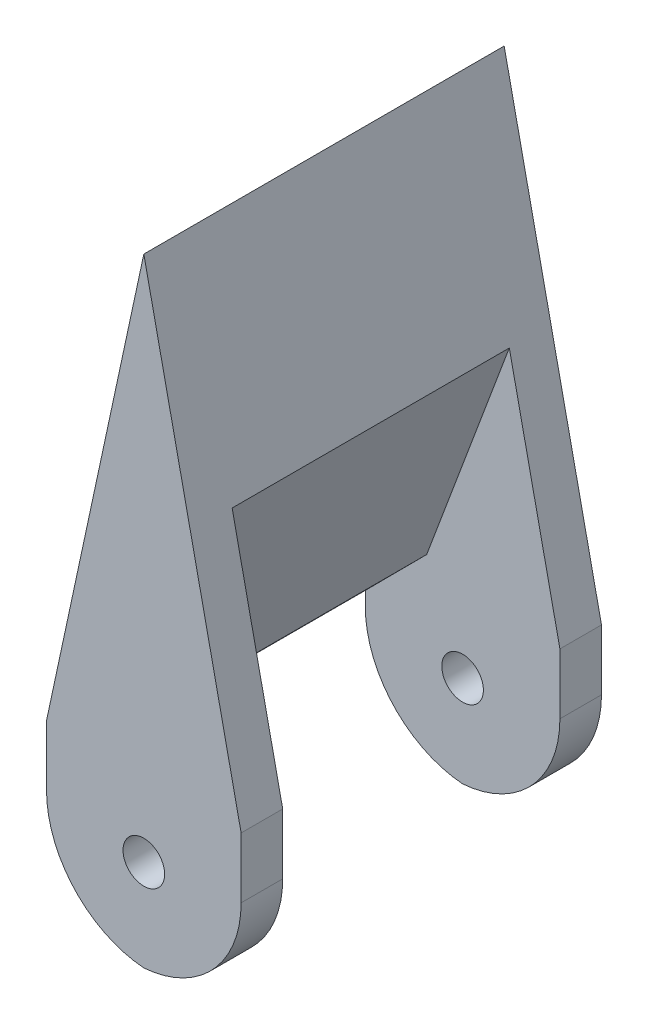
ISO-10303-21;
HEADER;
FILE_DESCRIPTION(('STEP AP214'),'2;1');
FILE_NAME('part.step','',(''),(''),'','','');
FILE_SCHEMA(('AUTOMOTIVE_DESIGN { 1 0 10303 214 1 1 1 1 }'));
ENDSEC;
DATA;
#1=APPLICATION_CONTEXT('core data for automotive mechanical design processes');
#2=APPLICATION_PROTOCOL_DEFINITION('international standard','automotive_design',2000,#1);
#3=PRODUCT_CONTEXT('',#1,'mechanical');
#4=PRODUCT('Part','Part','',(#3));
#5=PRODUCT_RELATED_PRODUCT_CATEGORY('part','',(#4));
#6=PRODUCT_DEFINITION_FORMATION('','',#4);
#7=PRODUCT_DEFINITION_CONTEXT('part definition',#1,'design');
#8=PRODUCT_DEFINITION('design','',#6,#7);
#9=PRODUCT_DEFINITION_SHAPE('','',#8);
#10=(LENGTH_UNIT() NAMED_UNIT(*) SI_UNIT(.MILLI.,.METRE.));
#11=(NAMED_UNIT(*) PLANE_ANGLE_UNIT() SI_UNIT($,.RADIAN.));
#12=(NAMED_UNIT(*) SI_UNIT($,.STERADIAN.) SOLID_ANGLE_UNIT());
#13=UNCERTAINTY_MEASURE_WITH_UNIT(LENGTH_MEASURE(1.E-05),#10,'distance_accuracy_value','');
#14=(GEOMETRIC_REPRESENTATION_CONTEXT(3) GLOBAL_UNCERTAINTY_ASSIGNED_CONTEXT((#13)) GLOBAL_UNIT_ASSIGNED_CONTEXT((#10,
#11,#12)) REPRESENTATION_CONTEXT('',''));
#15=CARTESIAN_POINT('',(0.,0.,0.));
#16=DIRECTION('',(0.,0.,1.));
#17=DIRECTION('',(1.,0.,0.));
#18=AXIS2_PLACEMENT_3D('',#15,#16,#17);
#19=CARTESIAN_POINT('',(-16.1838199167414,-7.6281283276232,6.5));
#20=DIRECTION('',(-1.,0.,0.));
#21=DIRECTION('',(0.,0.,1.));
#22=AXIS2_PLACEMENT_3D('',#19,#20,#21);
#23=PLANE('',#22);
#24=DIRECTION('',(0.,-1.,0.));
#25=VECTOR('',#24,1.);
#26=CARTESIAN_POINT('',(-16.1838199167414,-7.6281283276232,5.));
#27=LINE('',#26,#25);
#28=CARTESIAN_POINT('',(-16.1838199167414,-1.6441424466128,5.));
#29=VERTEX_POINT('',#28);
#30=CARTESIAN_POINT('',(-16.1838199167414,-3.8281283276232,5.));
#31=VERTEX_POINT('',#30);
#32=EDGE_CURVE('E51',#29,#31,#27,.T.);
#33=ORIENTED_EDGE('',*,*,#32,.F.);
#34=DIRECTION('',(0.,0.,-1.));
#35=VECTOR('',#34,1.);
#36=CARTESIAN_POINT('',(-16.1838199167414,-1.6441424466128,6.5));
#37=LINE('',#36,#35);
#38=CARTESIAN_POINT('',(-16.1838199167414,-1.6441424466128,6.5));
#39=VERTEX_POINT('',#38);
#40=EDGE_CURVE('E214',#39,#29,#37,.T.);
#41=ORIENTED_EDGE('',*,*,#40,.F.);
#42=DIRECTION('',(0.,1.,0.));
#43=VECTOR('',#42,1.);
#44=CARTESIAN_POINT('',(-16.1838199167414,-7.6281283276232,6.5));
#45=LINE('',#44,#43);
#46=CARTESIAN_POINT('',(-16.1838199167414,-3.8281283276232,6.5));
#47=VERTEX_POINT('',#46);
#48=EDGE_CURVE('E192',#47,#39,#45,.T.);
#49=ORIENTED_EDGE('',*,*,#48,.F.);
#50=DIRECTION('',(0.,0.,-1.));
#51=VECTOR('',#50,1.);
#52=CARTESIAN_POINT('',(-16.1838199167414,-3.8281283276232,6.5));
#53=LINE('',#52,#51);
#54=EDGE_CURVE('E218',#47,#31,#53,.T.);
#55=ORIENTED_EDGE('',*,*,#54,.T.);
#56=EDGE_LOOP('',(#33,#41,#49,#55));
#57=FACE_BOUND('',#56,.T.);
#58=ADVANCED_FACE('F36',(#57),#23,.F.);
#59=CARTESIAN_POINT('',(-19.694185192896,-4.3136274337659,6.5));
#60=DIRECTION('',(0.,0.,-1.));
#61=DIRECTION('',(-1.,0.,0.));
#62=AXIS2_PLACEMENT_3D('',#59,#60,#61);
#63=CYLINDRICAL_SURFACE('',#62,0.750000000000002);
#64=CARTESIAN_POINT('',(-19.694185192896,-4.3136274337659,6.5));
#65=DIRECTION('',(0.,0.,1.));
#66=DIRECTION('',(1.,0.,0.));
#67=AXIS2_PLACEMENT_3D('',#64,#65,#66);
#68=CIRCLE('',#67,0.750000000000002);
#69=CARTESIAN_POINT('',(-20.444185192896,-4.3136274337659,6.5));
#70=VERTEX_POINT('',#69);
#71=EDGE_CURVE('E182',#70,#70,#68,.T.);
#72=CARTESIAN_POINT('',(-19.694185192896,-4.3136274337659,5.));
#73=DIRECTION('',(0.,0.,-1.));
#74=DIRECTION('',(-1.,0.,0.));
#75=AXIS2_PLACEMENT_3D('',#72,#73,#74);
#76=CIRCLE('',#75,0.750000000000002);
#77=CARTESIAN_POINT('',(-20.444185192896,-4.3136274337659,5.));
#78=VERTEX_POINT('',#77);
#79=EDGE_CURVE('E164',#78,#78,#76,.T.);
#80=CARTESIAN_POINT('',(-20.444185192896,-4.3136274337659,6.5));
#81=CARTESIAN_POINT('',(-20.444185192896,-4.3136274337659,6.484375));
#82=CARTESIAN_POINT('',(-20.444185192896,-4.3136274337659,6.46875));
#83=CARTESIAN_POINT('',(-20.444185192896,-4.3136274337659,6.4375));
#84=CARTESIAN_POINT('',(-20.444185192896,-4.3136274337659,6.421875));
#85=CARTESIAN_POINT('',(-20.444185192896,-4.3136274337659,6.390625));
#86=CARTESIAN_POINT('',(-20.444185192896,-4.3136274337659,6.375));
#87=CARTESIAN_POINT('',(-20.444185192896,-4.3136274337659,6.34375));
#88=CARTESIAN_POINT('',(-20.444185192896,-4.3136274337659,6.328125));
#89=CARTESIAN_POINT('',(-20.444185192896,-4.3136274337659,6.296875));
#90=CARTESIAN_POINT('',(-20.444185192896,-4.3136274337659,6.28125));
#91=CARTESIAN_POINT('',(-20.444185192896,-4.3136274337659,6.25));
#92=CARTESIAN_POINT('',(-20.444185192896,-4.3136274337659,6.234375));
#93=CARTESIAN_POINT('',(-20.444185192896,-4.3136274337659,6.203125));
#94=CARTESIAN_POINT('',(-20.444185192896,-4.3136274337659,6.1875));
#95=CARTESIAN_POINT('',(-20.444185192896,-4.3136274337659,6.15625));
#96=CARTESIAN_POINT('',(-20.444185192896,-4.3136274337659,6.140625));
#97=CARTESIAN_POINT('',(-20.444185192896,-4.3136274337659,6.109375));
#98=CARTESIAN_POINT('',(-20.444185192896,-4.3136274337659,6.09375));
#99=CARTESIAN_POINT('',(-20.444185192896,-4.3136274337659,6.0625));
#100=CARTESIAN_POINT('',(-20.444185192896,-4.3136274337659,6.046875));
#101=CARTESIAN_POINT('',(-20.444185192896,-4.3136274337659,6.015625));
#102=CARTESIAN_POINT('',(-20.444185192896,-4.3136274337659,6.));
#103=CARTESIAN_POINT('',(-20.444185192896,-4.3136274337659,5.96875));
#104=CARTESIAN_POINT('',(-20.444185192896,-4.3136274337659,5.953125));
#105=CARTESIAN_POINT('',(-20.444185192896,-4.3136274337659,5.921875));
#106=CARTESIAN_POINT('',(-20.444185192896,-4.3136274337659,5.90625));
#107=CARTESIAN_POINT('',(-20.444185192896,-4.3136274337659,5.875));
#108=CARTESIAN_POINT('',(-20.444185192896,-4.3136274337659,5.859375));
#109=CARTESIAN_POINT('',(-20.444185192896,-4.3136274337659,5.828125));
#110=CARTESIAN_POINT('',(-20.444185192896,-4.3136274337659,5.8125));
#111=CARTESIAN_POINT('',(-20.444185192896,-4.3136274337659,5.78125));
#112=CARTESIAN_POINT('',(-20.444185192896,-4.3136274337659,5.765625));
#113=CARTESIAN_POINT('',(-20.444185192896,-4.3136274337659,5.734375));
#114=CARTESIAN_POINT('',(-20.444185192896,-4.3136274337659,5.71875));
#115=CARTESIAN_POINT('',(-20.444185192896,-4.3136274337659,5.6875));
#116=CARTESIAN_POINT('',(-20.444185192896,-4.3136274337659,5.671875));
#117=CARTESIAN_POINT('',(-20.444185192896,-4.3136274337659,5.640625));
#118=CARTESIAN_POINT('',(-20.444185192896,-4.3136274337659,5.625));
#119=CARTESIAN_POINT('',(-20.444185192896,-4.3136274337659,5.59375));
#120=CARTESIAN_POINT('',(-20.444185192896,-4.3136274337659,5.578125));
#121=CARTESIAN_POINT('',(-20.444185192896,-4.3136274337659,5.546875));
#122=CARTESIAN_POINT('',(-20.444185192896,-4.3136274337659,5.53125));
#123=CARTESIAN_POINT('',(-20.444185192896,-4.3136274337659,5.5));
#124=CARTESIAN_POINT('',(-20.444185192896,-4.3136274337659,5.484375));
#125=CARTESIAN_POINT('',(-20.444185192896,-4.3136274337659,5.453125));
#126=CARTESIAN_POINT('',(-20.444185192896,-4.3136274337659,5.4375));
#127=CARTESIAN_POINT('',(-20.444185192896,-4.3136274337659,5.40625));
#128=CARTESIAN_POINT('',(-20.444185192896,-4.3136274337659,5.390625));
#129=CARTESIAN_POINT('',(-20.444185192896,-4.3136274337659,5.359375));
#130=CARTESIAN_POINT('',(-20.444185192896,-4.3136274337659,5.34375));
#131=CARTESIAN_POINT('',(-20.444185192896,-4.3136274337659,5.3125));
#132=CARTESIAN_POINT('',(-20.444185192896,-4.3136274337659,5.296875));
#133=CARTESIAN_POINT('',(-20.444185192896,-4.3136274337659,5.265625));
#134=CARTESIAN_POINT('',(-20.444185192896,-4.3136274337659,5.25));
#135=CARTESIAN_POINT('',(-20.444185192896,-4.3136274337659,5.21875));
#136=CARTESIAN_POINT('',(-20.444185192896,-4.3136274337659,5.203125));
#137=CARTESIAN_POINT('',(-20.444185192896,-4.3136274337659,5.171875));
#138=CARTESIAN_POINT('',(-20.444185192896,-4.3136274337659,5.15625));
#139=CARTESIAN_POINT('',(-20.444185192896,-4.3136274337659,5.125));
#140=CARTESIAN_POINT('',(-20.444185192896,-4.3136274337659,5.109375));
#141=CARTESIAN_POINT('',(-20.444185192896,-4.3136274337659,5.078125));
#142=CARTESIAN_POINT('',(-20.444185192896,-4.3136274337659,5.0625));
#143=CARTESIAN_POINT('',(-20.444185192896,-4.3136274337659,5.03125));
#144=CARTESIAN_POINT('',(-20.444185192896,-4.3136274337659,5.015625));
#145=CARTESIAN_POINT('',(-20.444185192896,-4.3136274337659,5.));
#146=B_SPLINE_CURVE_WITH_KNOTS('',3,(#80,#81,#82,#83,#84,#85,#86,#87,#88,#89,#90,#91,#92,#93,
#94,#95,#96,#97,#98,#99,#100,#101,#102,#103,#104,#105,#106,#107,#108,#109,#110,#111,#112,#113,
#114,#115,#116,#117,#118,#119,#120,#121,#122,#123,#124,#125,#126,#127,#128,#129,#130,#131,#132,
#133,#134,#135,#136,#137,#138,#139,#140,#141,#142,#143,#144,#145),.UNSPECIFIED.,.F.,.F.,(4,2,2,
2,2,2,2,2,2,2,2,2,2,2,2,2,2,2,2,2,2,2,2,2,2,2,2,2,2,2,2,2,4),(0.,0.046875,0.0937500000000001,
0.140625,0.1875,0.234375,0.28125,0.328125,0.375,0.421875,0.46875,0.515625,0.5625,
0.609375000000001,0.656250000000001,0.703125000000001,0.750000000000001,0.796875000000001,
0.843750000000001,0.890625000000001,0.937500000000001,0.984375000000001,1.03125,1.078125,1.125,
1.171875,1.21875,1.265625,1.3125,1.359375,1.40625,1.453125,1.5),.UNSPECIFIED.);
#147=EDGE_CURVE('BSEAM293',#70,#78,#146,.T.);
#148=ORIENTED_EDGE('',*,*,#71,.T.);
#149=ORIENTED_EDGE('',*,*,#79,.T.);
#150=ORIENTED_EDGE('',*,*,#147,.T.);
#151=ORIENTED_EDGE('',*,*,#147,.F.);
#152=EDGE_LOOP('',(#148,#150,#149,#151));
#153=FACE_BOUND('',#152,.T.);
#154=ADVANCED_FACE('F293',(#153),#63,.F.);
#155=CARTESIAN_POINT('',(-19.4045504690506,-3.8281283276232,6.5));
#156=DIRECTION('',(0.,0.,-1.));
#157=DIRECTION('',(-1.,0.,0.));
#158=AXIS2_PLACEMENT_3D('',#155,#156,#157);
#159=CYLINDRICAL_SURFACE('',#158,3.8);
#160=DIRECTION('',(0.,0.,-1.));
#161=VECTOR('',#160,1.);
#162=CARTESIAN_POINT('',(-23.2045504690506,-3.8281283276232,6.5));
#163=LINE('',#162,#161);
#164=CARTESIAN_POINT('',(-23.2045504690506,-3.8281283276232,5.));
#165=VERTEX_POINT('',#164);
#166=CARTESIAN_POINT('',(-23.2045504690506,-3.8281283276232,6.5));
#167=VERTEX_POINT('',#166);
#168=EDGE_CURVE('E229',#165,#167,#163,.F.);
#169=ORIENTED_EDGE('',*,*,#168,.F.);
#170=CARTESIAN_POINT('',(-19.4045504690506,-3.8281283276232,5.));
#171=DIRECTION('',(0.,0.,-1.));
#172=DIRECTION('',(-1.,0.,0.));
#173=AXIS2_PLACEMENT_3D('',#170,#171,#172);
#174=CIRCLE('',#173,3.8);
#175=CARTESIAN_POINT('',(-19.694185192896,-7.61707431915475,5.));
#176=VERTEX_POINT('',#175);
#177=EDGE_CURVE('E156',#165,#176,#174,.F.);
#178=ORIENTED_EDGE('',*,*,#177,.T.);
#179=DIRECTION('',(0.,0.,-1.));
#180=VECTOR('',#179,1.);
#181=CARTESIAN_POINT('',(-19.694185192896,-7.61707431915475,0.));
#182=LINE('',#181,#180);
#183=CARTESIAN_POINT('',(-19.694185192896,-7.61707431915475,6.5));
#184=VERTEX_POINT('',#183);
#185=EDGE_CURVE('E189',#184,#176,#182,.T.);
#186=ORIENTED_EDGE('',*,*,#185,.F.);
#187=CARTESIAN_POINT('',(-19.4045504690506,-3.8281283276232,6.5));
#188=DIRECTION('',(0.,0.,-1.));
#189=DIRECTION('',(-1.,0.,0.));
#190=AXIS2_PLACEMENT_3D('',#187,#188,#189);
#191=CIRCLE('',#190,3.8);
#192=EDGE_CURVE('E59',#167,#184,#191,.F.);
#193=ORIENTED_EDGE('',*,*,#192,.F.);
#194=EDGE_LOOP('',(#169,#178,#186,#193));
#195=FACE_BOUND('',#194,.T.);
#196=ADVANCED_FACE('F251',(#195),#159,.T.);
#197=CARTESIAN_POINT('',(-19.9838199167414,-3.8281283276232,6.5));
#198=DIRECTION('',(0.,0.,-1.));
#199=DIRECTION('',(-1.,0.,0.));
#200=AXIS2_PLACEMENT_3D('',#197,#198,#199);
#201=CYLINDRICAL_SURFACE('',#200,3.8);
#202=ORIENTED_EDGE('',*,*,#185,.T.);
#203=CARTESIAN_POINT('',(-19.9838199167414,-3.8281283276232,5.));
#204=DIRECTION('',(0.,0.,-1.));
#205=DIRECTION('',(-1.,0.,0.));
#206=AXIS2_PLACEMENT_3D('',#203,#204,#205);
#207=CIRCLE('',#206,3.8);
#208=EDGE_CURVE('E233',#176,#31,#207,.F.);
#209=ORIENTED_EDGE('',*,*,#208,.T.);
#210=ORIENTED_EDGE('',*,*,#54,.F.);
#211=CARTESIAN_POINT('',(-19.9838199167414,-3.8281283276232,6.5));
#212=DIRECTION('',(0.,0.,-1.));
#213=DIRECTION('',(-1.,0.,0.));
#214=AXIS2_PLACEMENT_3D('',#211,#212,#213);
#215=CIRCLE('',#214,3.8);
#216=EDGE_CURVE('E227',#184,#47,#215,.F.);
#217=ORIENTED_EDGE('',*,*,#216,.F.);
#218=EDGE_LOOP('',(#202,#209,#210,#217));
#219=FACE_BOUND('',#218,.T.);
#220=ADVANCED_FACE('F248',(#219),#201,.T.);
#221=CARTESIAN_POINT('',(0.,0.,6.5));
#222=DIRECTION('',(0.,0.,-1.));
#223=DIRECTION('',(-1.,0.,0.));
#224=AXIS2_PLACEMENT_3D('',#221,#222,#223);
#225=PLANE('',#224);
#226=ORIENTED_EDGE('',*,*,#192,.T.);
#227=ORIENTED_EDGE('',*,*,#216,.T.);
#228=ORIENTED_EDGE('',*,*,#48,.T.);
#229=DIRECTION('',(-0.210156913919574,0.977667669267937,0.));
#230=VECTOR('',#229,1.);
#231=CARTESIAN_POINT('',(-16.1838199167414,-1.6441424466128,6.5));
#232=LINE('',#231,#230);
#233=CARTESIAN_POINT('',(-19.694185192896,14.6863725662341,6.5));
#234=VERTEX_POINT('',#233);
#235=EDGE_CURVE('E195',#39,#234,#232,.T.);
#236=ORIENTED_EDGE('',*,*,#235,.T.);
#237=DIRECTION('',(-0.210156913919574,-0.977667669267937,0.));
#238=VECTOR('',#237,1.);
#239=CARTESIAN_POINT('',(-23.2045504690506,-1.6441424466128,6.5));
#240=LINE('',#239,#238);
#241=CARTESIAN_POINT('',(-23.2045504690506,-1.6441424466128,6.5));
#242=VERTEX_POINT('',#241);
#243=EDGE_CURVE('E197',#234,#242,#240,.T.);
#244=ORIENTED_EDGE('',*,*,#243,.T.);
#245=DIRECTION('',(0.,-1.,0.));
#246=VECTOR('',#245,1.);
#247=CARTESIAN_POINT('',(-23.2045504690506,-7.6281283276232,6.5));
#248=LINE('',#247,#246);
#249=EDGE_CURVE('E190',#242,#167,#248,.T.);
#250=ORIENTED_EDGE('',*,*,#249,.T.);
#251=EDGE_LOOP('',(#226,#227,#228,#236,#244,#250));
#252=FACE_BOUND('',#251,.T.);
#253=ORIENTED_EDGE('',*,*,#71,.F.);
#254=EDGE_LOOP('',(#253));
#255=FACE_BOUND('',#254,.T.);
#256=ADVANCED_FACE('F255',(#252,#255),#225,.F.);
#257=CARTESIAN_POINT('',(0.,0.,-6.5));
#258=DIRECTION('',(0.,0.,-1.));
#259=DIRECTION('',(-1.,0.,0.));
#260=AXIS2_PLACEMENT_3D('',#257,#258,#259);
#261=PLANE('',#260);
#262=DIRECTION('',(0.,1.,0.));
#263=VECTOR('',#262,1.);
#264=CARTESIAN_POINT('',(-16.1838199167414,-7.6281283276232,-6.5));
#265=LINE('',#264,#263);
#266=CARTESIAN_POINT('',(-16.1838199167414,-3.8281283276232,-6.5));
#267=VERTEX_POINT('',#266);
#268=CARTESIAN_POINT('',(-16.1838199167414,-1.6441424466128,-6.5));
#269=VERTEX_POINT('',#268);
#270=EDGE_CURVE('E202',#267,#269,#265,.T.);
#271=ORIENTED_EDGE('',*,*,#270,.F.);
#272=CARTESIAN_POINT('',(-19.9838199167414,-3.8281283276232,-6.5));
#273=DIRECTION('',(0.,0.,-1.));
#274=DIRECTION('',(-1.,0.,0.));
#275=AXIS2_PLACEMENT_3D('',#272,#273,#274);
#276=CIRCLE('',#275,3.8);
#277=CARTESIAN_POINT('',(-19.694185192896,-7.61707431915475,-6.5));
#278=VERTEX_POINT('',#277);
#279=EDGE_CURVE('E223',#267,#278,#276,.T.);
#280=ORIENTED_EDGE('',*,*,#279,.T.);
#281=CARTESIAN_POINT('',(-19.4045504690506,-3.8281283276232,-6.5));
#282=DIRECTION('',(0.,0.,-1.));
#283=DIRECTION('',(-1.,0.,0.));
#284=AXIS2_PLACEMENT_3D('',#281,#282,#283);
#285=CIRCLE('',#284,3.8);
#286=CARTESIAN_POINT('',(-23.2045504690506,-3.8281283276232,-6.5));
#287=VERTEX_POINT('',#286);
#288=EDGE_CURVE('E221',#278,#287,#285,.T.);
#289=ORIENTED_EDGE('',*,*,#288,.T.);
#290=DIRECTION('',(0.,-1.,0.));
#291=VECTOR('',#290,1.);
#292=CARTESIAN_POINT('',(-23.2045504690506,-7.6281283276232,-6.5));
#293=LINE('',#292,#291);
#294=CARTESIAN_POINT('',(-23.2045504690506,-1.6441424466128,-6.5));
#295=VERTEX_POINT('',#294);
#296=EDGE_CURVE('E185',#295,#287,#293,.T.);
#297=ORIENTED_EDGE('',*,*,#296,.F.);
#298=DIRECTION('',(-0.210156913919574,-0.977667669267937,0.));
#299=VECTOR('',#298,1.);
#300=CARTESIAN_POINT('',(-23.2045504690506,-1.6441424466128,-6.5));
#301=LINE('',#300,#299);
#302=CARTESIAN_POINT('',(-19.694185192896,14.6863725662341,-6.5));
#303=VERTEX_POINT('',#302);
#304=EDGE_CURVE('E193',#303,#295,#301,.T.);
#305=ORIENTED_EDGE('',*,*,#304,.F.);
#306=DIRECTION('',(-0.210156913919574,0.977667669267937,0.));
#307=VECTOR('',#306,1.);
#308=CARTESIAN_POINT('',(-16.1838199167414,-1.6441424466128,-6.5));
#309=LINE('',#308,#307);
#310=EDGE_CURVE('E205',#269,#303,#309,.T.);
#311=ORIENTED_EDGE('',*,*,#310,.F.);
#312=EDGE_LOOP('',(#271,#280,#289,#297,#305,#311));
#313=FACE_BOUND('',#312,.T.);
#314=CARTESIAN_POINT('',(-19.694185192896,-4.3136274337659,-6.5));
#315=DIRECTION('',(0.,0.,1.));
#316=DIRECTION('',(1.,0.,0.));
#317=AXIS2_PLACEMENT_3D('',#314,#315,#316);
#318=CIRCLE('',#317,0.750000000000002);
#319=CARTESIAN_POINT('',(-20.444185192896,-4.3136274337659,-6.5));
#320=VERTEX_POINT('',#319);
#321=EDGE_CURVE('E186',#320,#320,#318,.T.);
#322=ORIENTED_EDGE('',*,*,#321,.T.);
#323=EDGE_LOOP('',(#322));
#324=FACE_BOUND('',#323,.T.);
#325=ADVANCED_FACE('F267',(#313,#324),#261,.T.);
#326=CARTESIAN_POINT('',(-23.2045504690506,-7.6281283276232,6.5));
#327=DIRECTION('',(1.,0.,0.));
#328=DIRECTION('',(0.,0.,-1.));
#329=AXIS2_PLACEMENT_3D('',#326,#327,#328);
#330=PLANE('',#329);
#331=CARTESIAN_POINT('',(-23.2045504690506,-3.8281283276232,-5.));
#332=VERTEX_POINT('',#331);
#333=EDGE_CURVE('E230',#287,#332,#163,.F.);
#334=ORIENTED_EDGE('',*,*,#333,.T.);
#335=DIRECTION('',(0.,1.,0.));
#336=VECTOR('',#335,1.);
#337=CARTESIAN_POINT('',(-23.2045504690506,-7.6281283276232,-5.));
#338=LINE('',#337,#336);
#339=CARTESIAN_POINT('',(-23.2045504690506,-3.32770882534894,-5.));
#340=VERTEX_POINT('',#339);
#341=EDGE_CURVE('E172',#332,#340,#338,.T.);
#342=ORIENTED_EDGE('',*,*,#341,.T.);
#343=DIRECTION('',(0.,0.,1.));
#344=VECTOR('',#343,1.);
#345=CARTESIAN_POINT('',(-23.2045504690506,-3.32770882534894,6.5));
#346=LINE('',#345,#344);
#347=CARTESIAN_POINT('',(-23.2045504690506,-3.32770882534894,5.));
#348=VERTEX_POINT('',#347);
#349=EDGE_CURVE('E12',#340,#348,#346,.T.);
#350=ORIENTED_EDGE('',*,*,#349,.T.);
#351=DIRECTION('',(0.,1.,0.));
#352=VECTOR('',#351,1.);
#353=CARTESIAN_POINT('',(-23.2045504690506,-7.6281283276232,5.));
#354=LINE('',#353,#352);
#355=EDGE_CURVE('E152',#165,#348,#354,.T.);
#356=ORIENTED_EDGE('',*,*,#355,.F.);
#357=ORIENTED_EDGE('',*,*,#168,.T.);
#358=ORIENTED_EDGE('',*,*,#249,.F.);
#359=DIRECTION('',(0.,0.,-1.));
#360=VECTOR('',#359,1.);
#361=CARTESIAN_POINT('',(-23.2045504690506,-1.6441424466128,6.5));
#362=LINE('',#361,#360);
#363=EDGE_CURVE('E199',#242,#295,#362,.T.);
#364=ORIENTED_EDGE('',*,*,#363,.T.);
#365=ORIENTED_EDGE('',*,*,#296,.T.);
#366=EDGE_LOOP('',(#334,#342,#350,#356,#357,#358,#364,#365));
#367=FACE_BOUND('',#366,.T.);
#368=ADVANCED_FACE('F254',(#367),#330,.F.);
#369=CARTESIAN_POINT('',(-16.1838199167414,-1.6441424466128,-5.));
#370=VERTEX_POINT('',#369);
#371=EDGE_CURVE('E213',#370,#269,#37,.T.);
#372=ORIENTED_EDGE('',*,*,#371,.F.);
#373=DIRECTION('',(0.,-1.,0.));
#374=VECTOR('',#373,1.);
#375=CARTESIAN_POINT('',(-16.1838199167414,-7.6281283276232,-5.));
#376=LINE('',#375,#374);
#377=CARTESIAN_POINT('',(-16.1838199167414,-3.8281283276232,-5.));
#378=VERTEX_POINT('',#377);
#379=EDGE_CURVE('E169',#370,#378,#376,.T.);
#380=ORIENTED_EDGE('',*,*,#379,.T.);
#381=EDGE_CURVE('E217',#378,#267,#53,.T.);
#382=ORIENTED_EDGE('',*,*,#381,.T.);
#383=ORIENTED_EDGE('',*,*,#270,.T.);
#384=EDGE_LOOP('',(#372,#380,#382,#383));
#385=FACE_BOUND('',#384,.T.);
#386=ADVANCED_FACE('F280',(#385),#23,.F.);
#387=CARTESIAN_POINT('',(-16.1838199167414,-1.6441424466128,6.5));
#388=DIRECTION('',(-0.977667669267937,-0.210156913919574,0.));
#389=DIRECTION('',(0.210156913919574,-0.977667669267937,0.));
#390=AXIS2_PLACEMENT_3D('',#387,#388,#389);
#391=PLANE('',#390);
#392=DIRECTION('',(0.,0.,-1.));
#393=VECTOR('',#392,1.);
#394=CARTESIAN_POINT('',(-18.0085149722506,6.84449268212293,6.5));
#395=LINE('',#394,#393);
#396=CARTESIAN_POINT('',(-18.0085149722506,6.84449268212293,5.));
#397=VERTEX_POINT('',#396);
#398=CARTESIAN_POINT('',(-18.0085149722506,6.84449268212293,-5.));
#399=VERTEX_POINT('',#398);
#400=EDGE_CURVE('E44',#397,#399,#395,.T.);
#401=ORIENTED_EDGE('',*,*,#400,.T.);
#402=DIRECTION('',(0.210156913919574,-0.977667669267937,0.));
#403=VECTOR('',#402,1.);
#404=CARTESIAN_POINT('',(-16.1838199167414,-1.6441424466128,-5.));
#405=LINE('',#404,#403);
#406=EDGE_CURVE('E175',#399,#370,#405,.T.);
#407=ORIENTED_EDGE('',*,*,#406,.T.);
#408=ORIENTED_EDGE('',*,*,#371,.T.);
#409=ORIENTED_EDGE('',*,*,#310,.T.);
#410=DIRECTION('',(0.,0.,-1.));
#411=VECTOR('',#410,1.);
#412=CARTESIAN_POINT('',(-19.694185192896,14.6863725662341,6.5));
#413=LINE('',#412,#411);
#414=EDGE_CURVE('E210',#234,#303,#413,.T.);
#415=ORIENTED_EDGE('',*,*,#414,.F.);
#416=ORIENTED_EDGE('',*,*,#235,.F.);
#417=ORIENTED_EDGE('',*,*,#40,.T.);
#418=DIRECTION('',(0.210156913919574,-0.977667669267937,0.));
#419=VECTOR('',#418,1.);
#420=CARTESIAN_POINT('',(-16.1838199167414,-1.6441424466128,5.));
#421=LINE('',#420,#419);
#422=EDGE_CURVE('E162',#397,#29,#421,.T.);
#423=ORIENTED_EDGE('',*,*,#422,.F.);
#424=EDGE_LOOP('',(#401,#407,#408,#409,#415,#416,#417,#423));
#425=FACE_BOUND('',#424,.T.);
#426=ADVANCED_FACE('F239',(#425),#391,.F.);
#427=CARTESIAN_POINT('',(-23.2045504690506,-1.6441424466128,6.5));
#428=DIRECTION('',(0.977667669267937,-0.210156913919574,0.));
#429=DIRECTION('',(0.210156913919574,0.977667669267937,0.));
#430=AXIS2_PLACEMENT_3D('',#427,#428,#429);
#431=PLANE('',#430);
#432=ORIENTED_EDGE('',*,*,#304,.T.);
#433=ORIENTED_EDGE('',*,*,#363,.F.);
#434=ORIENTED_EDGE('',*,*,#243,.F.);
#435=ORIENTED_EDGE('',*,*,#414,.T.);
#436=EDGE_LOOP('',(#432,#433,#434,#435));
#437=FACE_BOUND('',#436,.T.);
#438=ADVANCED_FACE('F261',(#437),#431,.F.);
#439=CARTESIAN_POINT('',(-19.694185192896,-4.3136274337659,-5.));
#440=DIRECTION('',(0.,0.,-1.));
#441=DIRECTION('',(-1.,0.,0.));
#442=AXIS2_PLACEMENT_3D('',#439,#440,#441);
#443=CIRCLE('',#442,0.750000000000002);
#444=CARTESIAN_POINT('',(-20.444185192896,-4.3136274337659,-5.));
#445=VERTEX_POINT('',#444);
#446=EDGE_CURVE('E178',#445,#445,#443,.T.);
#447=CARTESIAN_POINT('',(-20.444185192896,-4.3136274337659,-5.));
#448=CARTESIAN_POINT('',(-20.444185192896,-4.3136274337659,-5.015625));
#449=CARTESIAN_POINT('',(-20.444185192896,-4.3136274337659,-5.03125));
#450=CARTESIAN_POINT('',(-20.444185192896,-4.3136274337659,-5.0625));
#451=CARTESIAN_POINT('',(-20.444185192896,-4.3136274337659,-5.078125));
#452=CARTESIAN_POINT('',(-20.444185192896,-4.3136274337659,-5.109375));
#453=CARTESIAN_POINT('',(-20.444185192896,-4.3136274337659,-5.125));
#454=CARTESIAN_POINT('',(-20.444185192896,-4.3136274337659,-5.15625));
#455=CARTESIAN_POINT('',(-20.444185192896,-4.3136274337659,-5.171875));
#456=CARTESIAN_POINT('',(-20.444185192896,-4.3136274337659,-5.203125));
#457=CARTESIAN_POINT('',(-20.444185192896,-4.3136274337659,-5.21875));
#458=CARTESIAN_POINT('',(-20.444185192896,-4.3136274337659,-5.25));
#459=CARTESIAN_POINT('',(-20.444185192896,-4.3136274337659,-5.265625));
#460=CARTESIAN_POINT('',(-20.444185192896,-4.3136274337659,-5.296875));
#461=CARTESIAN_POINT('',(-20.444185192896,-4.3136274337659,-5.3125));
#462=CARTESIAN_POINT('',(-20.444185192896,-4.3136274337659,-5.34375));
#463=CARTESIAN_POINT('',(-20.444185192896,-4.3136274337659,-5.359375));
#464=CARTESIAN_POINT('',(-20.444185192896,-4.3136274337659,-5.390625));
#465=CARTESIAN_POINT('',(-20.444185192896,-4.3136274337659,-5.40625));
#466=CARTESIAN_POINT('',(-20.444185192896,-4.3136274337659,-5.4375));
#467=CARTESIAN_POINT('',(-20.444185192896,-4.3136274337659,-5.453125));
#468=CARTESIAN_POINT('',(-20.444185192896,-4.3136274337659,-5.484375));
#469=CARTESIAN_POINT('',(-20.444185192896,-4.3136274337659,-5.5));
#470=CARTESIAN_POINT('',(-20.444185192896,-4.3136274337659,-5.53125));
#471=CARTESIAN_POINT('',(-20.444185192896,-4.3136274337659,-5.546875));
#472=CARTESIAN_POINT('',(-20.444185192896,-4.3136274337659,-5.578125));
#473=CARTESIAN_POINT('',(-20.444185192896,-4.3136274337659,-5.59375));
#474=CARTESIAN_POINT('',(-20.444185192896,-4.3136274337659,-5.625));
#475=CARTESIAN_POINT('',(-20.444185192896,-4.3136274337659,-5.640625));
#476=CARTESIAN_POINT('',(-20.444185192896,-4.3136274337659,-5.671875));
#477=CARTESIAN_POINT('',(-20.444185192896,-4.3136274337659,-5.6875));
#478=CARTESIAN_POINT('',(-20.444185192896,-4.3136274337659,-5.71875));
#479=CARTESIAN_POINT('',(-20.444185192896,-4.3136274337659,-5.734375));
#480=CARTESIAN_POINT('',(-20.444185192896,-4.3136274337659,-5.765625));
#481=CARTESIAN_POINT('',(-20.444185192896,-4.3136274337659,-5.78125));
#482=CARTESIAN_POINT('',(-20.444185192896,-4.3136274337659,-5.8125));
#483=CARTESIAN_POINT('',(-20.444185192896,-4.3136274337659,-5.828125));
#484=CARTESIAN_POINT('',(-20.444185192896,-4.3136274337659,-5.859375));
#485=CARTESIAN_POINT('',(-20.444185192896,-4.3136274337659,-5.875));
#486=CARTESIAN_POINT('',(-20.444185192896,-4.3136274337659,-5.90625));
#487=CARTESIAN_POINT('',(-20.444185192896,-4.3136274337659,-5.921875));
#488=CARTESIAN_POINT('',(-20.444185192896,-4.3136274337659,-5.953125));
#489=CARTESIAN_POINT('',(-20.444185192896,-4.3136274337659,-5.96875));
#490=CARTESIAN_POINT('',(-20.444185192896,-4.3136274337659,-6.));
#491=CARTESIAN_POINT('',(-20.444185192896,-4.3136274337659,-6.015625));
#492=CARTESIAN_POINT('',(-20.444185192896,-4.3136274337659,-6.046875));
#493=CARTESIAN_POINT('',(-20.444185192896,-4.3136274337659,-6.0625));
#494=CARTESIAN_POINT('',(-20.444185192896,-4.3136274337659,-6.09375));
#495=CARTESIAN_POINT('',(-20.444185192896,-4.3136274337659,-6.109375));
#496=CARTESIAN_POINT('',(-20.444185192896,-4.3136274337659,-6.140625));
#497=CARTESIAN_POINT('',(-20.444185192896,-4.3136274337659,-6.15625));
#498=CARTESIAN_POINT('',(-20.444185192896,-4.3136274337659,-6.1875));
#499=CARTESIAN_POINT('',(-20.444185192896,-4.3136274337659,-6.203125));
#500=CARTESIAN_POINT('',(-20.444185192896,-4.3136274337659,-6.234375));
#501=CARTESIAN_POINT('',(-20.444185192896,-4.3136274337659,-6.25));
#502=CARTESIAN_POINT('',(-20.444185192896,-4.3136274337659,-6.28125));
#503=CARTESIAN_POINT('',(-20.444185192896,-4.3136274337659,-6.296875));
#504=CARTESIAN_POINT('',(-20.444185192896,-4.3136274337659,-6.328125));
#505=CARTESIAN_POINT('',(-20.444185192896,-4.3136274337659,-6.34375));
#506=CARTESIAN_POINT('',(-20.444185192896,-4.3136274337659,-6.375));
#507=CARTESIAN_POINT('',(-20.444185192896,-4.3136274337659,-6.390625));
#508=CARTESIAN_POINT('',(-20.444185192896,-4.3136274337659,-6.421875));
#509=CARTESIAN_POINT('',(-20.444185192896,-4.3136274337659,-6.4375));
#510=CARTESIAN_POINT('',(-20.444185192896,-4.3136274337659,-6.46875));
#511=CARTESIAN_POINT('',(-20.444185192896,-4.3136274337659,-6.484375));
#512=CARTESIAN_POINT('',(-20.444185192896,-4.3136274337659,-6.5));
#513=B_SPLINE_CURVE_WITH_KNOTS('',3,(#447,#448,#449,#450,#451,#452,#453,#454,#455,#456,#457,
#458,#459,#460,#461,#462,#463,#464,#465,#466,#467,#468,#469,#470,#471,#472,#473,#474,#475,#476,
#477,#478,#479,#480,#481,#482,#483,#484,#485,#486,#487,#488,#489,#490,#491,#492,#493,#494,#495,
#496,#497,#498,#499,#500,#501,#502,#503,#504,#505,#506,#507,#508,#509,#510,#511,#512),
.UNSPECIFIED.,.F.,.F.,(4,2,2,2,2,2,2,2,2,2,2,2,2,2,2,2,2,2,2,2,2,2,2,2,2,2,2,2,2,2,2,2,4),(0.,
0.046875,0.0937500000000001,0.140625,0.1875,0.234375,0.28125,0.328125,0.375,0.421875,0.46875,
0.515625,0.5625,0.609375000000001,0.656250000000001,0.703125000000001,0.750000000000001,
0.796875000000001,0.843750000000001,0.890625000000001,0.937500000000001,0.984375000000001,
1.03125,1.078125,1.125,1.171875,1.21875,1.265625,1.3125,1.359375,1.40625,1.453125,1.5),.UNSPECIFIED.);
#514=EDGE_CURVE('BSEAM289',#445,#320,#513,.T.);
#515=ORIENTED_EDGE('',*,*,#446,.F.);
#516=ORIENTED_EDGE('',*,*,#321,.F.);
#517=ORIENTED_EDGE('',*,*,#514,.T.);
#518=ORIENTED_EDGE('',*,*,#514,.F.);
#519=EDGE_LOOP('',(#515,#517,#516,#518));
#520=FACE_BOUND('',#519,.T.);
#521=ADVANCED_FACE('F289',(#520),#63,.F.);
#522=CARTESIAN_POINT('',(-19.4045504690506,-3.8281283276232,-5.));
#523=DIRECTION('',(0.,0.,-1.));
#524=DIRECTION('',(-1.,0.,0.));
#525=AXIS2_PLACEMENT_3D('',#522,#523,#524);
#526=CIRCLE('',#525,3.8);
#527=CARTESIAN_POINT('',(-19.694185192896,-7.61707431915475,-5.));
#528=VERTEX_POINT('',#527);
#529=EDGE_CURVE('E167',#332,#528,#526,.F.);
#530=ORIENTED_EDGE('',*,*,#529,.F.);
#531=ORIENTED_EDGE('',*,*,#333,.F.);
#532=ORIENTED_EDGE('',*,*,#288,.F.);
#533=EDGE_CURVE('E181',#528,#278,#182,.T.);
#534=ORIENTED_EDGE('',*,*,#533,.F.);
#535=EDGE_LOOP('',(#530,#531,#532,#534));
#536=FACE_BOUND('',#535,.T.);
#537=ADVANCED_FACE('F38',(#536),#159,.T.);
#538=CARTESIAN_POINT('',(-19.9838199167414,-3.8281283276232,-5.));
#539=DIRECTION('',(0.,0.,-1.));
#540=DIRECTION('',(-1.,0.,0.));
#541=AXIS2_PLACEMENT_3D('',#538,#539,#540);
#542=CIRCLE('',#541,3.8);
#543=EDGE_CURVE('E237',#528,#378,#542,.F.);
#544=ORIENTED_EDGE('',*,*,#543,.F.);
#545=ORIENTED_EDGE('',*,*,#533,.T.);
#546=ORIENTED_EDGE('',*,*,#279,.F.);
#547=ORIENTED_EDGE('',*,*,#381,.F.);
#548=EDGE_LOOP('',(#544,#545,#546,#547));
#549=FACE_BOUND('',#548,.T.);
#550=ADVANCED_FACE('F282',(#549),#201,.T.);
#551=CARTESIAN_POINT('',(-24.8214706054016,-4.95476252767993,-34.3736709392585));
#552=DIRECTION('',(-0.709312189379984,0.704894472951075,0.));
#553=DIRECTION('',(-0.704894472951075,-0.709312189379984,0.));
#554=AXIS2_PLACEMENT_3D('',#551,#552,#553);
#555=PLANE('',#554);
#556=DIRECTION('',(-0.704894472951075,-0.709312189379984,0.));
#557=VECTOR('',#556,1.);
#558=CARTESIAN_POINT('',(-24.8214706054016,-4.95476252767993,-5.));
#559=LINE('',#558,#557);
#560=CARTESIAN_POINT('',(-20.9874094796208,-1.09667256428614,-5.));
#561=VERTEX_POINT('',#560);
#562=EDGE_CURVE('E148',#561,#340,#559,.T.);
#563=ORIENTED_EDGE('',*,*,#562,.F.);
#564=DIRECTION('',(0.,0.,1.));
#565=VECTOR('',#564,1.);
#566=CARTESIAN_POINT('',(-20.9874094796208,-1.09667256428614,-34.3736709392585));
#567=LINE('',#566,#565);
#568=CARTESIAN_POINT('',(-20.9874094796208,-1.09667256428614,5.));
#569=VERTEX_POINT('',#568);
#570=EDGE_CURVE('E136',#561,#569,#567,.T.);
#571=ORIENTED_EDGE('',*,*,#570,.T.);
#572=DIRECTION('',(-0.704894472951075,-0.709312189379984,0.));
#573=VECTOR('',#572,1.);
#574=CARTESIAN_POINT('',(-24.8214706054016,-4.95476252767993,5.));
#575=LINE('',#574,#573);
#576=EDGE_CURVE('E141',#569,#348,#575,.T.);
#577=ORIENTED_EDGE('',*,*,#576,.T.);
#578=ORIENTED_EDGE('',*,*,#349,.F.);
#579=EDGE_LOOP('',(#563,#571,#577,#578));
#580=FACE_BOUND('',#579,.T.);
#581=ADVANCED_FACE('F146',(#580),#555,.F.);
#582=CARTESIAN_POINT('',(-20.9874094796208,-1.09667256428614,-34.3736709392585));
#583=DIRECTION('',(-0.936292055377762,0.351222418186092,0.));
#584=DIRECTION('',(-0.351222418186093,-0.936292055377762,0.));
#585=AXIS2_PLACEMENT_3D('',#582,#583,#584);
#586=PLANE('',#585);
#587=DIRECTION('',(-0.351222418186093,-0.936292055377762,0.));
#588=VECTOR('',#587,1.);
#589=CARTESIAN_POINT('',(-20.9874094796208,-1.09667256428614,5.));
#590=LINE('',#589,#588);
#591=EDGE_CURVE('E132',#397,#569,#590,.T.);
#592=ORIENTED_EDGE('',*,*,#591,.T.);
#593=ORIENTED_EDGE('',*,*,#570,.F.);
#594=DIRECTION('',(-0.351222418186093,-0.936292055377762,0.));
#595=VECTOR('',#594,1.);
#596=CARTESIAN_POINT('',(-20.9874094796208,-1.09667256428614,-5.));
#597=LINE('',#596,#595);
#598=EDGE_CURVE('E140',#399,#561,#597,.T.);
#599=ORIENTED_EDGE('',*,*,#598,.F.);
#600=ORIENTED_EDGE('',*,*,#400,.F.);
#601=EDGE_LOOP('',(#592,#593,#599,#600));
#602=FACE_BOUND('',#601,.T.);
#603=ADVANCED_FACE('F134',(#602),#586,.F.);
#604=CARTESIAN_POINT('',(0.,0.,-5.));
#605=DIRECTION('',(0.,0.,-1.));
#606=DIRECTION('',(-1.,0.,0.));
#607=AXIS2_PLACEMENT_3D('',#604,#605,#606);
#608=PLANE('',#607);
#609=ORIENTED_EDGE('',*,*,#446,.T.);
#610=EDGE_LOOP('',(#609));
#611=FACE_BOUND('',#610,.T.);
#612=ORIENTED_EDGE('',*,*,#598,.T.);
#613=ORIENTED_EDGE('',*,*,#562,.T.);
#614=ORIENTED_EDGE('',*,*,#341,.F.);
#615=ORIENTED_EDGE('',*,*,#529,.T.);
#616=ORIENTED_EDGE('',*,*,#543,.T.);
#617=ORIENTED_EDGE('',*,*,#379,.F.);
#618=ORIENTED_EDGE('',*,*,#406,.F.);
#619=EDGE_LOOP('',(#612,#613,#614,#615,#616,#617,#618));
#620=FACE_BOUND('',#619,.T.);
#621=ADVANCED_FACE('F276',(#611,#620),#608,.F.);
#622=CARTESIAN_POINT('',(0.,0.,5.));
#623=DIRECTION('',(0.,0.,-1.));
#624=DIRECTION('',(-1.,0.,0.));
#625=AXIS2_PLACEMENT_3D('',#622,#623,#624);
#626=PLANE('',#625);
#627=ORIENTED_EDGE('',*,*,#79,.F.);
#628=EDGE_LOOP('',(#627));
#629=FACE_BOUND('',#628,.T.);
#630=ORIENTED_EDGE('',*,*,#422,.T.);
#631=ORIENTED_EDGE('',*,*,#32,.T.);
#632=ORIENTED_EDGE('',*,*,#208,.F.);
#633=ORIENTED_EDGE('',*,*,#177,.F.);
#634=ORIENTED_EDGE('',*,*,#355,.T.);
#635=ORIENTED_EDGE('',*,*,#576,.F.);
#636=ORIENTED_EDGE('',*,*,#591,.F.);
#637=EDGE_LOOP('',(#630,#631,#632,#633,#634,#635,#636));
#638=FACE_BOUND('',#637,.T.);
#639=ADVANCED_FACE('F150',(#629,#638),#626,.T.);
#640=CLOSED_SHELL('',(#58,#154,#196,#220,#256,#325,#368,#386,#426,#438,#521,#537,#550,#581,#603,
#621,#639));
#641=MANIFOLD_SOLID_BREP('B2',#640);
#642=ADVANCED_BREP_SHAPE_REPRESENTATION('',(#18,#641),#14);
#643=SHAPE_DEFINITION_REPRESENTATION(#9,#642);
ENDSEC;
END-ISO-10303-21;
